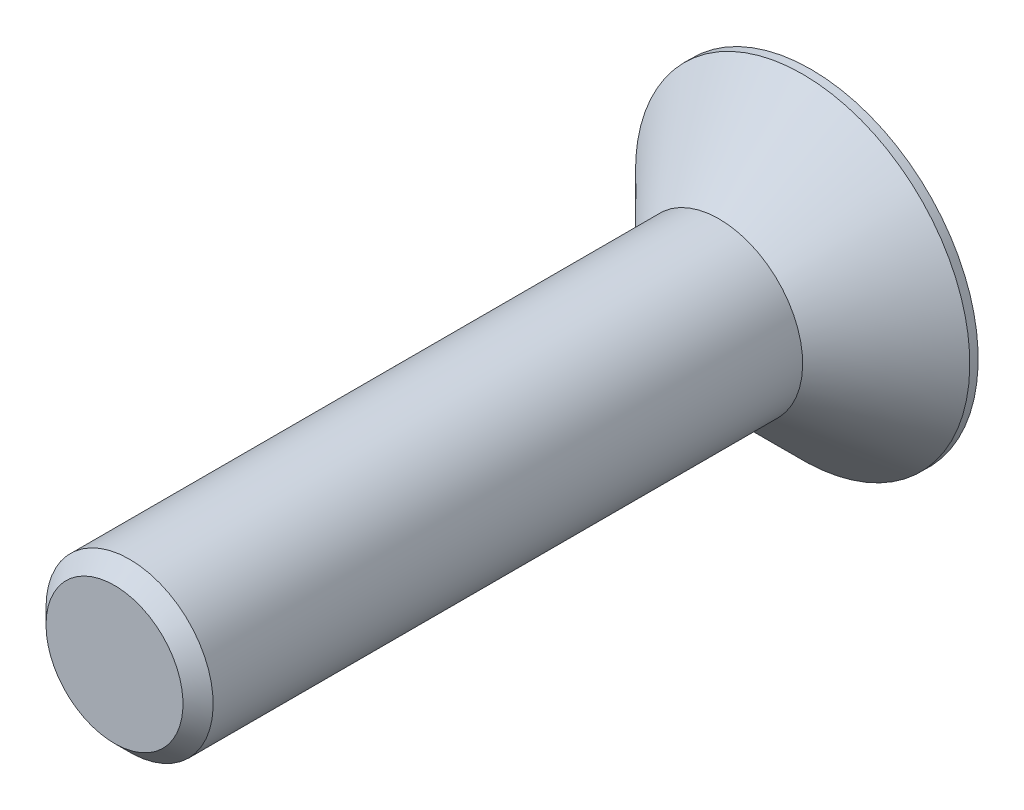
ISO-10303-21;
HEADER;
FILE_DESCRIPTION(('STEP AP214'),'2;1');
FILE_NAME('part.step','',(''),(''),'','','');
FILE_SCHEMA(('AUTOMOTIVE_DESIGN { 1 0 10303 214 1 1 1 1 }'));
ENDSEC;
DATA;
#1=APPLICATION_CONTEXT('core data for automotive mechanical design processes');
#2=APPLICATION_PROTOCOL_DEFINITION('international standard','automotive_design',2000,#1);
#3=PRODUCT_CONTEXT('',#1,'mechanical');
#4=PRODUCT('Part','Part','',(#3));
#5=PRODUCT_RELATED_PRODUCT_CATEGORY('part','',(#4));
#6=PRODUCT_DEFINITION_FORMATION('','',#4);
#7=PRODUCT_DEFINITION_CONTEXT('part definition',#1,'design');
#8=PRODUCT_DEFINITION('design','',#6,#7);
#9=PRODUCT_DEFINITION_SHAPE('','',#8);
#10=(LENGTH_UNIT() NAMED_UNIT(*) SI_UNIT(.MILLI.,.METRE.));
#11=(NAMED_UNIT(*) PLANE_ANGLE_UNIT() SI_UNIT($,.RADIAN.));
#12=(NAMED_UNIT(*) SI_UNIT($,.STERADIAN.) SOLID_ANGLE_UNIT());
#13=UNCERTAINTY_MEASURE_WITH_UNIT(LENGTH_MEASURE(1.E-05),#10,'distance_accuracy_value','');
#14=(GEOMETRIC_REPRESENTATION_CONTEXT(3) GLOBAL_UNCERTAINTY_ASSIGNED_CONTEXT((#13)) GLOBAL_UNIT_ASSIGNED_CONTEXT((#10,
#11,#12)) REPRESENTATION_CONTEXT('',''));
#15=CARTESIAN_POINT('',(0.,0.,0.));
#16=DIRECTION('',(0.,0.,1.));
#17=DIRECTION('',(1.,0.,0.));
#18=AXIS2_PLACEMENT_3D('',#15,#16,#17);
#19=CARTESIAN_POINT('',(1.38777878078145E-13,0.,2.79999999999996));
#20=DIRECTION('',(0.,0.,-1.));
#21=DIRECTION('',(0.,1.,0.));
#22=AXIS2_PLACEMENT_3D('',#19,#20,#21);
#23=PLANE('',#22);
#24=DIRECTION('',(0.500000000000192,-0.866025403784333,0.));
#25=VECTOR('',#24,1.);
#26=CARTESIAN_POINT('',(1.15470053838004,1.99999999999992,2.8));
#27=LINE('',#26,#25);
#28=CARTESIAN_POINT('',(2.30940107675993,0.,2.8));
#29=VERTEX_POINT('',#28);
#30=CARTESIAN_POINT('',(1.15470053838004,1.99999999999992,2.8));
#31=VERTEX_POINT('',#30);
#32=EDGE_CURVE('E74',#29,#31,#27,.F.);
#33=ORIENTED_EDGE('',*,*,#32,.F.);
#34=DIRECTION('',(-0.500000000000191,-0.866025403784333,0.));
#35=VECTOR('',#34,1.);
#36=CARTESIAN_POINT('',(2.3094010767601,-1.09287578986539E-13,2.8));
#37=LINE('',#36,#35);
#38=CARTESIAN_POINT('',(1.15470053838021,-2.00000000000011,2.79999999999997));
#39=VERTEX_POINT('',#38);
#40=EDGE_CURVE('E107',#39,#29,#37,.F.);
#41=ORIENTED_EDGE('',*,*,#40,.F.);
#42=DIRECTION('',(1.,0.,0.));
#43=VECTOR('',#42,1.);
#44=CARTESIAN_POINT('',(1.1547005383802,-2.0000000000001,2.79999999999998));
#45=LINE('',#44,#43);
#46=CARTESIAN_POINT('',(-1.15470053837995,-2.00000000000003,2.8));
#47=VERTEX_POINT('',#46);
#48=EDGE_CURVE('E59',#47,#39,#45,.T.);
#49=ORIENTED_EDGE('',*,*,#48,.F.);
#50=DIRECTION('',(-0.500000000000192,0.866025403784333,0.));
#51=VECTOR('',#50,1.);
#52=CARTESIAN_POINT('',(-1.15470053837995,-2.00000000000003,2.8));
#53=LINE('',#52,#51);
#54=CARTESIAN_POINT('',(-2.30940107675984,0.,2.8));
#55=VERTEX_POINT('',#54);
#56=EDGE_CURVE('E100',#55,#47,#53,.F.);
#57=ORIENTED_EDGE('',*,*,#56,.F.);
#58=DIRECTION('',(0.500000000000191,0.866025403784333,0.));
#59=VECTOR('',#58,1.);
#60=CARTESIAN_POINT('',(-2.30940107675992,0.,2.8));
#61=LINE('',#60,#59);
#62=CARTESIAN_POINT('',(-1.15470053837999,1.99999999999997,2.8));
#63=VERTEX_POINT('',#62);
#64=EDGE_CURVE('E87',#63,#55,#61,.F.);
#65=ORIENTED_EDGE('',*,*,#64,.F.);
#66=DIRECTION('',(1.,0.,0.));
#67=VECTOR('',#66,1.);
#68=CARTESIAN_POINT('',(-1.15470053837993,1.99999999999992,2.8));
#69=LINE('',#68,#67);
#70=EDGE_CURVE('E85',#31,#63,#69,.F.);
#71=ORIENTED_EDGE('',*,*,#70,.F.);
#72=EDGE_LOOP('',(#33,#41,#49,#57,#65,#71));
#73=FACE_BOUND('',#72,.T.);
#74=ADVANCED_FACE('F16',(#73),#23,.T.);
#75=CARTESIAN_POINT('',(1.15470053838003,1.99999999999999,0.));
#76=DIRECTION('',(-0.866025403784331,-0.500000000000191,0.));
#77=DIRECTION('',(0.500000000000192,-0.866025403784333,0.));
#78=AXIS2_PLACEMENT_3D('',#75,#76,#77);
#79=PLANE('',#78);
#80=DIRECTION('',(0.,0.,1.));
#81=VECTOR('',#80,1.);
#82=CARTESIAN_POINT('',(2.30940107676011,-1.196959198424E-13,0.));
#83=LINE('',#82,#81);
#84=CARTESIAN_POINT('',(2.30940107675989,0.,0.));
#85=VERTEX_POINT('',#84);
#86=EDGE_CURVE('E80',#29,#85,#83,.F.);
#87=ORIENTED_EDGE('',*,*,#86,.F.);
#88=ORIENTED_EDGE('',*,*,#32,.T.);
#89=DIRECTION('',(0.,0.,-1.));
#90=VECTOR('',#89,1.);
#91=CARTESIAN_POINT('',(1.15470053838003,1.99999999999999,0.));
#92=LINE('',#91,#90);
#93=CARTESIAN_POINT('',(1.15470053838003,1.99999999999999,0.));
#94=VERTEX_POINT('',#93);
#95=EDGE_CURVE('E78',#94,#31,#92,.F.);
#96=ORIENTED_EDGE('',*,*,#95,.F.);
#97=DIRECTION('',(-0.500000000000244,0.866025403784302,0.));
#98=VECTOR('',#97,1.);
#99=CARTESIAN_POINT('',(2.30940107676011,-1.196959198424E-13,0.));
#100=LINE('',#99,#98);
#101=EDGE_CURVE('E55',#85,#94,#100,.T.);
#102=ORIENTED_EDGE('',*,*,#101,.F.);
#103=EDGE_LOOP('',(#87,#88,#96,#102));
#104=FACE_BOUND('',#103,.T.);
#105=ADVANCED_FACE('F76',(#104),#79,.T.);
#106=CARTESIAN_POINT('',(-1.15470053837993,1.99999999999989,0.));
#107=DIRECTION('',(0.,-1.,0.));
#108=DIRECTION('',(0.,0.,-1.));
#109=AXIS2_PLACEMENT_3D('',#106,#107,#108);
#110=PLANE('',#109);
#111=ORIENTED_EDGE('',*,*,#95,.T.);
#112=ORIENTED_EDGE('',*,*,#70,.T.);
#113=DIRECTION('',(0.,0.,1.));
#114=VECTOR('',#113,1.);
#115=CARTESIAN_POINT('',(-1.15470053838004,2.00000000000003,0.));
#116=LINE('',#115,#114);
#117=CARTESIAN_POINT('',(-1.15470053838,1.99999999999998,0.));
#118=VERTEX_POINT('',#117);
#119=EDGE_CURVE('E90',#118,#63,#116,.T.);
#120=ORIENTED_EDGE('',*,*,#119,.F.);
#121=DIRECTION('',(1.,0.,0.));
#122=VECTOR('',#121,1.);
#123=CARTESIAN_POINT('',(1.38777878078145E-13,1.99999999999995,0.));
#124=LINE('',#123,#122);
#125=EDGE_CURVE('E94',#94,#118,#124,.F.);
#126=ORIENTED_EDGE('',*,*,#125,.F.);
#127=EDGE_LOOP('',(#111,#112,#120,#126));
#128=FACE_BOUND('',#127,.T.);
#129=ADVANCED_FACE('F92',(#128),#110,.T.);
#130=CARTESIAN_POINT('',(-2.30940107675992,0.,0.));
#131=DIRECTION('',(0.866025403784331,-0.500000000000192,0.));
#132=DIRECTION('',(0.500000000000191,0.866025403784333,0.));
#133=AXIS2_PLACEMENT_3D('',#130,#131,#132);
#134=PLANE('',#133);
#135=ORIENTED_EDGE('',*,*,#119,.T.);
#136=ORIENTED_EDGE('',*,*,#64,.T.);
#137=DIRECTION('',(0.,0.,1.));
#138=VECTOR('',#137,1.);
#139=CARTESIAN_POINT('',(-2.30940107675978,0.,0.));
#140=LINE('',#139,#138);
#141=CARTESIAN_POINT('',(-2.30940107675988,0.,0.));
#142=VERTEX_POINT('',#141);
#143=EDGE_CURVE('E98',#142,#55,#140,.T.);
#144=ORIENTED_EDGE('',*,*,#143,.F.);
#145=DIRECTION('',(-0.500000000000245,-0.866025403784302,0.));
#146=VECTOR('',#145,1.);
#147=CARTESIAN_POINT('',(-1.15470053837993,1.99999999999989,0.));
#148=LINE('',#147,#146);
#149=EDGE_CURVE('E120',#118,#142,#148,.T.);
#150=ORIENTED_EDGE('',*,*,#149,.F.);
#151=EDGE_LOOP('',(#135,#136,#144,#150));
#152=FACE_BOUND('',#151,.T.);
#153=ADVANCED_FACE('F189',(#152),#134,.T.);
#154=CARTESIAN_POINT('',(-1.1547005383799,-2.00000000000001,0.));
#155=DIRECTION('',(0.866025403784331,0.500000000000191,0.));
#156=DIRECTION('',(-0.500000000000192,0.866025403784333,0.));
#157=AXIS2_PLACEMENT_3D('',#154,#155,#156);
#158=PLANE('',#157);
#159=ORIENTED_EDGE('',*,*,#143,.T.);
#160=ORIENTED_EDGE('',*,*,#56,.T.);
#161=DIRECTION('',(0.,0.,1.));
#162=VECTOR('',#161,1.);
#163=CARTESIAN_POINT('',(-1.1547005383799,-2.00000000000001,0.));
#164=LINE('',#163,#162);
#165=CARTESIAN_POINT('',(-1.1547005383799,-2.00000000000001,0.));
#166=VERTEX_POINT('',#165);
#167=EDGE_CURVE('E102',#166,#47,#164,.T.);
#168=ORIENTED_EDGE('',*,*,#167,.F.);
#169=DIRECTION('',(0.500000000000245,-0.866025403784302,0.));
#170=VECTOR('',#169,1.);
#171=CARTESIAN_POINT('',(-2.30940107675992,0.,0.));
#172=LINE('',#171,#170);
#173=EDGE_CURVE('E117',#142,#166,#172,.T.);
#174=ORIENTED_EDGE('',*,*,#173,.F.);
#175=EDGE_LOOP('',(#159,#160,#168,#174));
#176=FACE_BOUND('',#175,.T.);
#177=ADVANCED_FACE('F186',(#176),#158,.T.);
#178=CARTESIAN_POINT('',(1.15470053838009,-2.00000000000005,0.));
#179=DIRECTION('',(0.,1.,0.));
#180=DIRECTION('',(0.,0.,1.));
#181=AXIS2_PLACEMENT_3D('',#178,#179,#180);
#182=PLANE('',#181);
#183=ORIENTED_EDGE('',*,*,#167,.T.);
#184=ORIENTED_EDGE('',*,*,#48,.T.);
#185=DIRECTION('',(0.,0.,1.));
#186=VECTOR('',#185,1.);
#187=CARTESIAN_POINT('',(1.15470053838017,-2.00000000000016,0.));
#188=LINE('',#187,#186);
#189=CARTESIAN_POINT('',(1.15470053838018,-2.00000000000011,0.));
#190=VERTEX_POINT('',#189);
#191=EDGE_CURVE('E35',#190,#39,#188,.T.);
#192=ORIENTED_EDGE('',*,*,#191,.F.);
#193=DIRECTION('',(1.,0.,0.));
#194=VECTOR('',#193,1.);
#195=CARTESIAN_POINT('',(0.,-2.00000000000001,0.));
#196=LINE('',#195,#194);
#197=EDGE_CURVE('E114',#166,#190,#196,.T.);
#198=ORIENTED_EDGE('',*,*,#197,.F.);
#199=EDGE_LOOP('',(#183,#184,#192,#198));
#200=FACE_BOUND('',#199,.T.);
#201=ADVANCED_FACE('F151',(#200),#182,.T.);
#202=CARTESIAN_POINT('',(2.30940107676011,-1.196959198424E-13,0.));
#203=DIRECTION('',(-0.866025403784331,0.500000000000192,0.));
#204=DIRECTION('',(-0.500000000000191,-0.866025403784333,0.));
#205=AXIS2_PLACEMENT_3D('',#202,#203,#204);
#206=PLANE('',#205);
#207=ORIENTED_EDGE('',*,*,#191,.T.);
#208=ORIENTED_EDGE('',*,*,#40,.T.);
#209=ORIENTED_EDGE('',*,*,#86,.T.);
#210=DIRECTION('',(0.500000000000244,0.866025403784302,0.));
#211=VECTOR('',#210,1.);
#212=CARTESIAN_POINT('',(1.15470053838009,-2.00000000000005,0.));
#213=LINE('',#212,#211);
#214=EDGE_CURVE('E111',#190,#85,#213,.T.);
#215=ORIENTED_EDGE('',*,*,#214,.F.);
#216=EDGE_LOOP('',(#207,#208,#209,#215));
#217=FACE_BOUND('',#216,.T.);
#218=ADVANCED_FACE('F141',(#217),#206,.T.);
#219=CARTESIAN_POINT('',(1.11022302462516E-13,0.,0.));
#220=DIRECTION('',(0.,0.,-1.));
#221=DIRECTION('',(0.,1.,0.));
#222=AXIS2_PLACEMENT_3D('',#219,#220,#221);
#223=PLANE('',#222);
#224=ORIENTED_EDGE('',*,*,#197,.T.);
#225=ORIENTED_EDGE('',*,*,#214,.T.);
#226=ORIENTED_EDGE('',*,*,#101,.T.);
#227=ORIENTED_EDGE('',*,*,#125,.T.);
#228=ORIENTED_EDGE('',*,*,#149,.T.);
#229=ORIENTED_EDGE('',*,*,#173,.T.);
#230=EDGE_LOOP('',(#224,#225,#226,#227,#228,#229));
#231=FACE_BOUND('',#230,.T.);
#232=CARTESIAN_POINT('',(1.11022302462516E-13,0.,0.));
#233=DIRECTION('',(0.,0.,-1.));
#234=DIRECTION('',(0.,1.,0.));
#235=AXIS2_PLACEMENT_3D('',#232,#233,#234);
#236=CIRCLE('',#235,6.);
#237=CARTESIAN_POINT('',(1.11022302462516E-13,5.99999999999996,0.));
#238=VERTEX_POINT('',#237);
#239=EDGE_CURVE('E20',#238,#238,#236,.F.);
#240=ORIENTED_EDGE('',*,*,#239,.F.);
#241=EDGE_LOOP('',(#240));
#242=FACE_BOUND('',#241,.T.);
#243=ADVANCED_FACE('F138',(#231,#242),#223,.T.);
#244=CARTESIAN_POINT('',(1.11022302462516E-13,-2.45850000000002,25.));
#245=DIRECTION('',(0.,0.,-1.));
#246=DIRECTION('',(0.,1.,0.));
#247=AXIS2_PLACEMENT_3D('',#244,#245,#246);
#248=PLANE('',#247);
#249=CARTESIAN_POINT('',(0.,0.,25.0000000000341));
#250=DIRECTION('',(0.,0.,-1.));
#251=DIRECTION('',(-1.,0.,0.));
#252=AXIS2_PLACEMENT_3D('',#249,#250,#251);
#253=CIRCLE('',#252,2.45849999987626);
#254=CARTESIAN_POINT('',(-2.4584999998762,0.,25.0000000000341));
#255=VERTEX_POINT('',#254);
#256=EDGE_CURVE('E127',#255,#255,#253,.T.);
#257=ORIENTED_EDGE('',*,*,#256,.F.);
#258=EDGE_LOOP('',(#257));
#259=FACE_BOUND('',#258,.T.);
#260=ADVANCED_FACE('F140',(#259),#248,.F.);
#261=CARTESIAN_POINT('',(0.,0.,12.4999999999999));
#262=DIRECTION('',(0.,0.,-1.));
#263=DIRECTION('',(0.,1.,0.));
#264=AXIS2_PLACEMENT_3D('',#261,#262,#263);
#265=CYLINDRICAL_SURFACE('',#264,6.);
#266=CARTESIAN_POINT('',(0.,0.,0.29999999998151));
#267=DIRECTION('',(0.,0.,-1.));
#268=DIRECTION('',(-0.479425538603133,-0.877582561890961,0.));
#269=AXIS2_PLACEMENT_3D('',#266,#267,#268);
#270=CIRCLE('',#269,6.00000000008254);
#271=CARTESIAN_POINT('',(-2.87655323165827,-5.26549537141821,0.299999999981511));
#272=VERTEX_POINT('',#271);
#273=EDGE_CURVE('E125',#272,#272,#270,.F.);
#274=ORIENTED_EDGE('',*,*,#273,.F.);
#275=EDGE_LOOP('',(#274));
#276=FACE_BOUND('',#275,.T.);
#277=ORIENTED_EDGE('',*,*,#239,.T.);
#278=EDGE_LOOP('',(#277));
#279=FACE_BOUND('',#278,.T.);
#280=ADVANCED_FACE('F136',(#276,#279),#265,.T.);
#281=CARTESIAN_POINT('',(0.,0.,24.458500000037));
#282=DIRECTION('',(0.,0.,-1.));
#283=DIRECTION('',(-1.,0.,0.));
#284=AXIS2_PLACEMENT_3D('',#281,#282,#283);
#285=CONICAL_SURFACE('',#284,2.99999999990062,0.785398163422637);
#286=ORIENTED_EDGE('',*,*,#256,.T.);
#287=EDGE_LOOP('',(#286));
#288=FACE_BOUND('',#287,.T.);
#289=CARTESIAN_POINT('',(0.,0.,24.4585));
#290=DIRECTION('',(0.,0.,-1.));
#291=DIRECTION('',(0.,1.,0.));
#292=AXIS2_PLACEMENT_3D('',#289,#290,#291);
#293=CIRCLE('',#292,3.);
#294=CARTESIAN_POINT('',(0.,2.99999999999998,24.4585));
#295=VERTEX_POINT('',#294);
#296=EDGE_CURVE('E26',#295,#295,#293,.T.);
#297=ORIENTED_EDGE('',*,*,#296,.F.);
#298=EDGE_LOOP('',(#297));
#299=FACE_BOUND('',#298,.T.);
#300=ADVANCED_FACE('F160',(#288,#299),#285,.T.);
#301=CARTESIAN_POINT('',(0.,0.,0.29999999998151));
#302=DIRECTION('',(0.,0.,-1.));
#303=DIRECTION('',(0.,1.,0.));
#304=AXIS2_PLACEMENT_3D('',#301,#302,#303);
#305=CONICAL_SURFACE('',#304,6.00000000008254,0.785398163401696);
#306=CARTESIAN_POINT('',(1.2490009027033E-13,0.,3.29999999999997));
#307=DIRECTION('',(0.,0.,-1.));
#308=DIRECTION('',(0.,1.,0.));
#309=AXIS2_PLACEMENT_3D('',#306,#307,#308);
#310=CIRCLE('',#309,3.);
#311=CARTESIAN_POINT('',(1.2490009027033E-13,2.99999999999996,3.29999999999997));
#312=VERTEX_POINT('',#311);
#313=EDGE_CURVE('E11',#312,#312,#310,.F.);
#314=ORIENTED_EDGE('',*,*,#313,.F.);
#315=EDGE_LOOP('',(#314));
#316=FACE_BOUND('',#315,.T.);
#317=ORIENTED_EDGE('',*,*,#273,.T.);
#318=EDGE_LOOP('',(#317));
#319=FACE_BOUND('',#318,.T.);
#320=ADVANCED_FACE('F155',(#316,#319),#305,.T.);
#321=CARTESIAN_POINT('',(0.,0.,12.4999999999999));
#322=DIRECTION('',(0.,0.,-1.));
#323=DIRECTION('',(0.,1.,0.));
#324=AXIS2_PLACEMENT_3D('',#321,#322,#323);
#325=CYLINDRICAL_SURFACE('',#324,3.);
#326=ORIENTED_EDGE('',*,*,#296,.T.);
#327=EDGE_LOOP('',(#326));
#328=FACE_BOUND('',#327,.T.);
#329=ORIENTED_EDGE('',*,*,#313,.T.);
#330=EDGE_LOOP('',(#329));
#331=FACE_BOUND('',#330,.T.);
#332=ADVANCED_FACE('F18',(#328,#331),#325,.T.);
#333=CLOSED_SHELL('',(#74,#105,#129,#153,#177,#201,#218,#243,#260,#280,#300,#320,#332));
#334=MANIFOLD_SOLID_BREP('B1',#333);
#335=ADVANCED_BREP_SHAPE_REPRESENTATION('',(#18,#334),#14);
#336=SHAPE_DEFINITION_REPRESENTATION(#9,#335);
ENDSEC;
END-ISO-10303-21;
